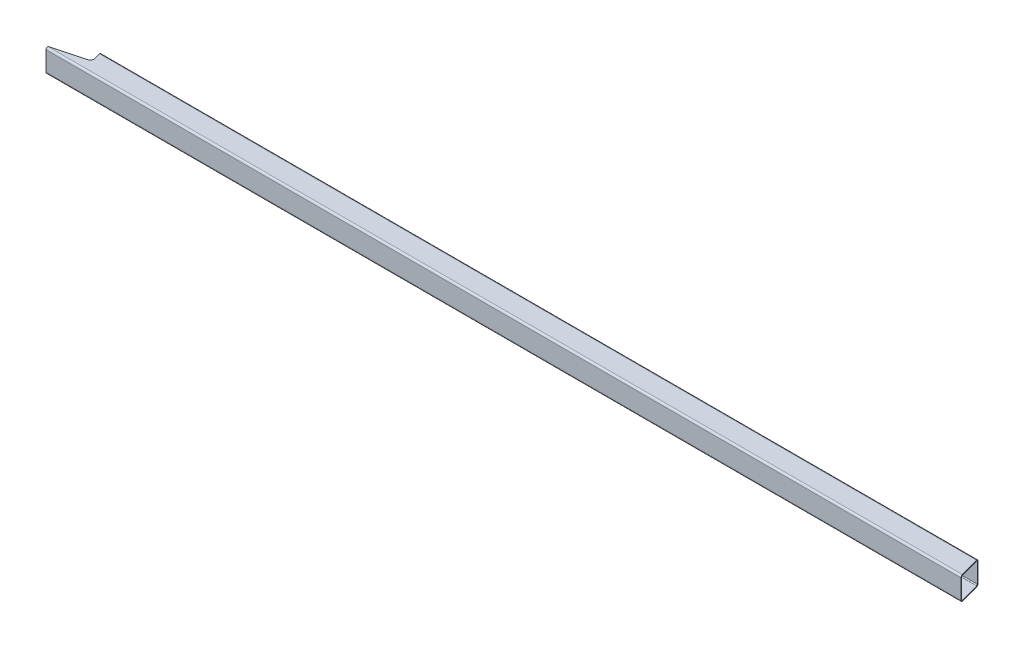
ISO-10303-21;
HEADER;
FILE_DESCRIPTION(('STEP AP214'),'2;1');
FILE_NAME('part.step','',(''),(''),'','','');
FILE_SCHEMA(('AUTOMOTIVE_DESIGN { 1 0 10303 214 1 1 1 1 }'));
ENDSEC;
DATA;
#1=APPLICATION_CONTEXT('core data for automotive mechanical design processes');
#2=APPLICATION_PROTOCOL_DEFINITION('international standard','automotive_design',2000,#1);
#3=PRODUCT_CONTEXT('',#1,'mechanical');
#4=PRODUCT('Part','Part','',(#3));
#5=PRODUCT_RELATED_PRODUCT_CATEGORY('part','',(#4));
#6=PRODUCT_DEFINITION_FORMATION('','',#4);
#7=PRODUCT_DEFINITION_CONTEXT('part definition',#1,'design');
#8=PRODUCT_DEFINITION('design','',#6,#7);
#9=PRODUCT_DEFINITION_SHAPE('','',#8);
#10=(LENGTH_UNIT() NAMED_UNIT(*) SI_UNIT(.MILLI.,.METRE.));
#11=(NAMED_UNIT(*) PLANE_ANGLE_UNIT() SI_UNIT($,.RADIAN.));
#12=(NAMED_UNIT(*) SI_UNIT($,.STERADIAN.) SOLID_ANGLE_UNIT());
#13=UNCERTAINTY_MEASURE_WITH_UNIT(LENGTH_MEASURE(1.E-05),#10,'distance_accuracy_value','');
#14=(GEOMETRIC_REPRESENTATION_CONTEXT(3) GLOBAL_UNCERTAINTY_ASSIGNED_CONTEXT((#13)) GLOBAL_UNIT_ASSIGNED_CONTEXT((#10,
#11,#12)) REPRESENTATION_CONTEXT('',''));
#15=CARTESIAN_POINT('',(0.,0.,0.));
#16=DIRECTION('',(0.,0.,1.));
#17=DIRECTION('',(1.,0.,0.));
#18=AXIS2_PLACEMENT_3D('',#15,#16,#17);
#19=CARTESIAN_POINT('',(0.,32.004,32.004));
#20=DIRECTION('',(1.,0.,0.));
#21=DIRECTION('',(0.,0.,-1.));
#22=AXIS2_PLACEMENT_3D('',#19,#20,#21);
#23=PLANE('',#22);
#24=CARTESIAN_POINT('',(0.,32.004,32.004));
#25=DIRECTION('',(1.,0.,0.));
#26=DIRECTION('',(0.,0.,-1.));
#27=AXIS2_PLACEMENT_3D('',#24,#25,#26);
#28=CIRCLE('',#27,6.096);
#29=CARTESIAN_POINT('',(0.,38.1,32.0040000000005));
#30=VERTEX_POINT('',#29);
#31=CARTESIAN_POINT('',(0.,32.004,38.1));
#32=VERTEX_POINT('',#31);
#33=EDGE_CURVE('E288',#30,#32,#28,.T.);
#34=ORIENTED_EDGE('',*,*,#33,.F.);
#35=DIRECTION('',(0.,-1.,0.));
#36=VECTOR('',#35,1.);
#37=CARTESIAN_POINT('',(0.,32.004,32.0040000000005));
#38=LINE('',#37,#36);
#39=CARTESIAN_POINT('',(0.,35.052,32.0040000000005));
#40=VERTEX_POINT('',#39);
#41=EDGE_CURVE('E280',#30,#40,#38,.T.);
#42=ORIENTED_EDGE('',*,*,#41,.T.);
#43=CARTESIAN_POINT('',(0.,32.004,32.004));
#44=DIRECTION('',(1.,0.,0.));
#45=DIRECTION('',(0.,0.,-1.));
#46=AXIS2_PLACEMENT_3D('',#43,#44,#45);
#47=CIRCLE('',#46,3.048);
#48=CARTESIAN_POINT('',(0.,32.004,35.052));
#49=VERTEX_POINT('',#48);
#50=EDGE_CURVE('E286',#40,#49,#47,.T.);
#51=ORIENTED_EDGE('',*,*,#50,.T.);
#52=DIRECTION('',(0.,-1.,0.));
#53=VECTOR('',#52,1.);
#54=CARTESIAN_POINT('',(0.,32.004,35.052));
#55=LINE('',#54,#53);
#56=CARTESIAN_POINT('',(0.,-32.004,35.052));
#57=VERTEX_POINT('',#56);
#58=EDGE_CURVE('E299',#49,#57,#55,.T.);
#59=ORIENTED_EDGE('',*,*,#58,.T.);
#60=CARTESIAN_POINT('',(0.,-32.004,32.004));
#61=DIRECTION('',(1.,0.,0.));
#62=DIRECTION('',(0.,0.,-1.));
#63=AXIS2_PLACEMENT_3D('',#60,#61,#62);
#64=CIRCLE('',#63,3.04800000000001);
#65=CARTESIAN_POINT('',(0.,-35.052,32.0040000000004));
#66=VERTEX_POINT('',#65);
#67=EDGE_CURVE('E306',#57,#66,#64,.T.);
#68=ORIENTED_EDGE('',*,*,#67,.T.);
#69=CARTESIAN_POINT('',(0.,-38.1,32.0040000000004));
#70=VERTEX_POINT('',#69);
#71=EDGE_CURVE('E292',#66,#70,#38,.T.);
#72=ORIENTED_EDGE('',*,*,#71,.T.);
#73=CARTESIAN_POINT('',(0.,-32.004,32.004));
#74=DIRECTION('',(1.,0.,0.));
#75=DIRECTION('',(0.,0.,-1.));
#76=AXIS2_PLACEMENT_3D('',#73,#74,#75);
#77=CIRCLE('',#76,6.096);
#78=CARTESIAN_POINT('',(0.,-32.004,38.1));
#79=VERTEX_POINT('',#78);
#80=EDGE_CURVE('E210',#79,#70,#77,.T.);
#81=ORIENTED_EDGE('',*,*,#80,.F.);
#82=DIRECTION('',(0.,-1.,0.));
#83=VECTOR('',#82,1.);
#84=CARTESIAN_POINT('',(0.,32.004,38.1));
#85=LINE('',#84,#83);
#86=EDGE_CURVE('E219',#32,#79,#85,.T.);
#87=ORIENTED_EDGE('',*,*,#86,.F.);
#88=EDGE_LOOP('',(#34,#42,#51,#59,#68,#72,#81,#87));
#89=FACE_BOUND('',#88,.T.);
#90=ADVANCED_FACE('F49',(#89),#23,.F.);
#91=CARTESIAN_POINT('',(3048.,32.004,32.004));
#92=DIRECTION('',(-1.,0.,0.));
#93=DIRECTION('',(0.,0.,1.));
#94=AXIS2_PLACEMENT_3D('',#91,#92,#93);
#95=CYLINDRICAL_SURFACE('',#94,6.096);
#96=DIRECTION('',(-1.,0.,0.));
#97=VECTOR('',#96,1.);
#98=CARTESIAN_POINT('',(3048.,32.004,38.1));
#99=LINE('',#98,#97);
#100=CARTESIAN_POINT('',(3013.65132777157,32.004,38.1));
#101=VERTEX_POINT('',#100);
#102=EDGE_CURVE('E199',#101,#32,#99,.T.);
#103=ORIENTED_EDGE('',*,*,#102,.F.);
#104=CARTESIAN_POINT('',(3012.01790949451,32.004,32.004));
#105=DIRECTION('',(-0.965925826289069,0.,0.258819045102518));
#106=DIRECTION('',(-0.258819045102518,0.,-0.965925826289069));
#107=AXIS2_PLACEMENT_3D('',#104,#105,#106);
#108=ELLIPSE('',#107,6.31104359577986,6.096);
#109=CARTESIAN_POINT('',(3012.01790949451,38.1,32.004));
#110=VERTEX_POINT('',#109);
#111=EDGE_CURVE('E186',#101,#110,#108,.T.);
#112=ORIENTED_EDGE('',*,*,#111,.T.);
#113=DIRECTION('',(-1.,0.,0.));
#114=VECTOR('',#113,1.);
#115=CARTESIAN_POINT('',(3048.,38.1,32.004));
#116=LINE('',#115,#114);
#117=EDGE_CURVE('E197',#110,#30,#116,.T.);
#118=ORIENTED_EDGE('',*,*,#117,.T.);
#119=ORIENTED_EDGE('',*,*,#33,.T.);
#120=EDGE_LOOP('',(#103,#112,#118,#119));
#121=FACE_BOUND('',#120,.T.);
#122=ADVANCED_FACE('F51',(#121),#95,.T.);
#123=CARTESIAN_POINT('',(3048.,32.004,38.1));
#124=DIRECTION('',(0.,0.,-1.));
#125=DIRECTION('',(0.,1.,0.));
#126=AXIS2_PLACEMENT_3D('',#123,#124,#125);
#127=PLANE('',#126);
#128=DIRECTION('',(-1.,0.,0.));
#129=VECTOR('',#128,1.);
#130=CARTESIAN_POINT('',(3048.,-32.004,38.1));
#131=LINE('',#130,#129);
#132=CARTESIAN_POINT('',(3013.65132777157,-32.004,38.1));
#133=VERTEX_POINT('',#132);
#134=EDGE_CURVE('E234',#133,#79,#131,.T.);
#135=ORIENTED_EDGE('',*,*,#134,.F.);
#136=DIRECTION('',(0.,1.,0.));
#137=VECTOR('',#136,1.);
#138=CARTESIAN_POINT('',(3013.65132777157,32.004,38.1));
#139=LINE('',#138,#137);
#140=EDGE_CURVE('E202',#133,#101,#139,.T.);
#141=ORIENTED_EDGE('',*,*,#140,.T.);
#142=ORIENTED_EDGE('',*,*,#102,.T.);
#143=ORIENTED_EDGE('',*,*,#86,.T.);
#144=EDGE_LOOP('',(#135,#141,#142,#143));
#145=FACE_BOUND('',#144,.T.);
#146=ADVANCED_FACE('F346',(#145),#127,.F.);
#147=CARTESIAN_POINT('',(3048.,-32.004,32.004));
#148=DIRECTION('',(-1.,0.,0.));
#149=DIRECTION('',(0.,0.,1.));
#150=AXIS2_PLACEMENT_3D('',#147,#148,#149);
#151=CYLINDRICAL_SURFACE('',#150,6.096);
#152=DIRECTION('',(-1.,0.,0.));
#153=VECTOR('',#152,1.);
#154=CARTESIAN_POINT('',(3048.,-38.1,32.004));
#155=LINE('',#154,#153);
#156=CARTESIAN_POINT('',(3012.01790949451,-38.1,32.004));
#157=VERTEX_POINT('',#156);
#158=EDGE_CURVE('E231',#157,#70,#155,.T.);
#159=ORIENTED_EDGE('',*,*,#158,.F.);
#160=CARTESIAN_POINT('',(3012.01790949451,-32.004,32.004));
#161=DIRECTION('',(-0.965925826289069,0.,0.258819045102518));
#162=DIRECTION('',(-0.258819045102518,0.,-0.965925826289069));
#163=AXIS2_PLACEMENT_3D('',#160,#161,#162);
#164=ELLIPSE('',#163,6.31104359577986,6.096);
#165=EDGE_CURVE('E353',#157,#133,#164,.T.);
#166=ORIENTED_EDGE('',*,*,#165,.T.);
#167=ORIENTED_EDGE('',*,*,#134,.T.);
#168=ORIENTED_EDGE('',*,*,#80,.T.);
#169=EDGE_LOOP('',(#159,#166,#167,#168));
#170=FACE_BOUND('',#169,.T.);
#171=ADVANCED_FACE('F351',(#170),#151,.T.);
#172=CARTESIAN_POINT('',(3048.,-38.1,-32.004));
#173=DIRECTION('',(0.,1.,0.));
#174=DIRECTION('',(0.,0.,1.));
#175=AXIS2_PLACEMENT_3D('',#172,#173,#174);
#176=PLANE('',#175);
#177=DIRECTION('',(-1.,0.,0.));
#178=VECTOR('',#177,1.);
#179=CARTESIAN_POINT('',(3048.,-38.1,-32.004));
#180=LINE('',#179,#178);
#181=CARTESIAN_POINT('',(2994.86701758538,-38.1,-32.004));
#182=VERTEX_POINT('',#181);
#183=CARTESIAN_POINT('',(106.362572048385,-38.1,-32.004));
#184=VERTEX_POINT('',#183);
#185=EDGE_CURVE('E228',#182,#184,#180,.T.);
#186=ORIENTED_EDGE('',*,*,#185,.F.);
#187=DIRECTION('',(0.258819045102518,0.,0.965925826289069));
#188=VECTOR('',#187,1.);
#189=CARTESIAN_POINT('',(3031.89818169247,-38.1,106.198185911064));
#190=LINE('',#189,#188);
#191=EDGE_CURVE('E192',#182,#157,#190,.T.);
#192=ORIENTED_EDGE('',*,*,#191,.T.);
#193=ORIENTED_EDGE('',*,*,#158,.T.);
#194=DIRECTION('',(0.965925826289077,0.,-0.258819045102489));
#195=VECTOR('',#194,1.);
#196=CARTESIAN_POINT('',(-20.3280589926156,-38.1,37.4508869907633));
#197=LINE('',#196,#195);
#198=CARTESIAN_POINT('',(102.972372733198,-38.1,4.41263588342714));
#199=VERTEX_POINT('',#198);
#200=EDGE_CURVE('E375',#70,#199,#197,.T.);
#201=ORIENTED_EDGE('',*,*,#200,.T.);
#202=CARTESIAN_POINT('',(99.6853708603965,-38.1,-7.85462211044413));
#203=DIRECTION('',(0.,1.,0.));
#204=DIRECTION('',(0.,0.,1.));
#205=AXIS2_PLACEMENT_3D('',#202,#203,#204);
#206=CIRCLE('',#205,12.7);
#207=CARTESIAN_POINT('',(111.952628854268,-38.1,-11.1416239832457));
#208=VERTEX_POINT('',#207);
#209=EDGE_CURVE('E379',#199,#208,#206,.T.);
#210=ORIENTED_EDGE('',*,*,#209,.T.);
#211=DIRECTION('',(-0.258819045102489,0.,-0.965925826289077));
#212=VECTOR('',#211,1.);
#213=CARTESIAN_POINT('',(87.57750420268,-38.1,-102.110827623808));
#214=LINE('',#213,#212);
#215=EDGE_CURVE('E383',#208,#184,#214,.T.);
#216=ORIENTED_EDGE('',*,*,#215,.T.);
#217=EDGE_LOOP('',(#186,#192,#193,#201,#210,#216));
#218=FACE_BOUND('',#217,.T.);
#219=ADVANCED_FACE('F429',(#218),#176,.F.);
#220=CARTESIAN_POINT('',(3048.,-32.004,-32.004));
#221=DIRECTION('',(-1.,0.,0.));
#222=DIRECTION('',(0.,0.,1.));
#223=AXIS2_PLACEMENT_3D('',#220,#221,#222);
#224=CYLINDRICAL_SURFACE('',#223,6.096);
#225=DIRECTION('',(-1.,0.,0.));
#226=VECTOR('',#225,1.);
#227=CARTESIAN_POINT('',(3048.,-32.004,-38.1));
#228=LINE('',#227,#226);
#229=CARTESIAN_POINT('',(2993.23359930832,-32.004,-38.1));
#230=VERTEX_POINT('',#229);
#231=CARTESIAN_POINT('',(104.729153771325,-32.004,-38.1));
#232=VERTEX_POINT('',#231);
#233=EDGE_CURVE('E225',#230,#232,#228,.T.);
#234=ORIENTED_EDGE('',*,*,#233,.F.);
#235=CARTESIAN_POINT('',(2994.86701758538,-32.004,-32.004));
#236=DIRECTION('',(-0.965925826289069,0.,0.258819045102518));
#237=DIRECTION('',(-0.258819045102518,0.,-0.965925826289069));
#238=AXIS2_PLACEMENT_3D('',#235,#236,#237);
#239=ELLIPSE('',#238,6.31104359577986,6.096);
#240=EDGE_CURVE('E356',#230,#182,#239,.T.);
#241=ORIENTED_EDGE('',*,*,#240,.T.);
#242=ORIENTED_EDGE('',*,*,#185,.T.);
#243=CARTESIAN_POINT('',(106.362572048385,-32.004,-32.004));
#244=DIRECTION('',(0.965925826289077,0.,-0.258819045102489));
#245=DIRECTION('',(-0.258819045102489,0.,-0.965925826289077));
#246=AXIS2_PLACEMENT_3D('',#243,#244,#245);
#247=ELLIPSE('',#246,6.31104359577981,6.096);
#248=EDGE_CURVE('E300',#184,#232,#247,.T.);
#249=ORIENTED_EDGE('',*,*,#248,.T.);
#250=EDGE_LOOP('',(#234,#241,#242,#249));
#251=FACE_BOUND('',#250,.T.);
#252=ADVANCED_FACE('F426',(#251),#224,.T.);
#253=CARTESIAN_POINT('',(3048.,-32.004,-38.1));
#254=DIRECTION('',(0.,0.,1.));
#255=DIRECTION('',(0.,-1.,0.));
#256=AXIS2_PLACEMENT_3D('',#253,#254,#255);
#257=PLANE('',#256);
#258=DIRECTION('',(-1.,0.,0.));
#259=VECTOR('',#258,1.);
#260=CARTESIAN_POINT('',(3048.,32.004,-38.1));
#261=LINE('',#260,#259);
#262=CARTESIAN_POINT('',(2993.23359930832,32.004,-38.1));
#263=VERTEX_POINT('',#262);
#264=CARTESIAN_POINT('',(104.729153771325,32.004,-38.1));
#265=VERTEX_POINT('',#264);
#266=EDGE_CURVE('E216',#263,#265,#261,.T.);
#267=ORIENTED_EDGE('',*,*,#266,.F.);
#268=DIRECTION('',(0.,-1.,0.));
#269=VECTOR('',#268,1.);
#270=CARTESIAN_POINT('',(2993.23359930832,-32.004,-38.1));
#271=LINE('',#270,#269);
#272=EDGE_CURVE('E364',#263,#230,#271,.T.);
#273=ORIENTED_EDGE('',*,*,#272,.T.);
#274=ORIENTED_EDGE('',*,*,#233,.T.);
#275=DIRECTION('',(0.,1.,0.));
#276=VECTOR('',#275,1.);
#277=CARTESIAN_POINT('',(104.729153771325,-32.0039999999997,-38.1));
#278=LINE('',#277,#276);
#279=EDGE_CURVE('E309',#232,#265,#278,.T.);
#280=ORIENTED_EDGE('',*,*,#279,.T.);
#281=EDGE_LOOP('',(#267,#273,#274,#280));
#282=FACE_BOUND('',#281,.T.);
#283=ADVANCED_FACE('F420',(#282),#257,.F.);
#284=CARTESIAN_POINT('',(3048.,32.004,-32.004));
#285=DIRECTION('',(-1.,0.,0.));
#286=DIRECTION('',(0.,0.,1.));
#287=AXIS2_PLACEMENT_3D('',#284,#285,#286);
#288=CYLINDRICAL_SURFACE('',#287,6.096);
#289=DIRECTION('',(-1.,0.,0.));
#290=VECTOR('',#289,1.);
#291=CARTESIAN_POINT('',(3048.,38.1,-32.004));
#292=LINE('',#291,#290);
#293=CARTESIAN_POINT('',(2994.86701758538,38.1,-32.004));
#294=VERTEX_POINT('',#293);
#295=CARTESIAN_POINT('',(106.362572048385,38.1,-32.004));
#296=VERTEX_POINT('',#295);
#297=EDGE_CURVE('E209',#294,#296,#292,.T.);
#298=ORIENTED_EDGE('',*,*,#297,.F.);
#299=CARTESIAN_POINT('',(2994.86701758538,32.004,-32.004));
#300=DIRECTION('',(-0.965925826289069,0.,0.258819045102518));
#301=DIRECTION('',(-0.258819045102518,0.,-0.965925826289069));
#302=AXIS2_PLACEMENT_3D('',#299,#300,#301);
#303=ELLIPSE('',#302,6.31104359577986,6.096);
#304=EDGE_CURVE('E65',#294,#263,#303,.T.);
#305=ORIENTED_EDGE('',*,*,#304,.T.);
#306=ORIENTED_EDGE('',*,*,#266,.T.);
#307=CARTESIAN_POINT('',(106.362572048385,32.004,-32.004));
#308=DIRECTION('',(0.965925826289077,0.,-0.258819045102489));
#309=DIRECTION('',(-0.258819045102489,0.,-0.965925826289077));
#310=AXIS2_PLACEMENT_3D('',#307,#308,#309);
#311=ELLIPSE('',#310,6.31104359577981,6.096);
#312=EDGE_CURVE('E410',#265,#296,#311,.T.);
#313=ORIENTED_EDGE('',*,*,#312,.T.);
#314=EDGE_LOOP('',(#298,#305,#306,#313));
#315=FACE_BOUND('',#314,.T.);
#316=ADVANCED_FACE('F483',(#315),#288,.T.);
#317=CARTESIAN_POINT('',(3048.,38.1,32.004));
#318=DIRECTION('',(0.,-1.,0.));
#319=DIRECTION('',(0.,0.,-1.));
#320=AXIS2_PLACEMENT_3D('',#317,#318,#319);
#321=PLANE('',#320);
#322=ORIENTED_EDGE('',*,*,#117,.F.);
#323=DIRECTION('',(0.258819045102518,0.,0.965925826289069));
#324=VECTOR('',#323,1.);
#325=CARTESIAN_POINT('',(3031.89818169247,38.1,106.198185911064));
#326=LINE('',#325,#324);
#327=EDGE_CURVE('E183',#294,#110,#326,.T.);
#328=ORIENTED_EDGE('',*,*,#327,.F.);
#329=ORIENTED_EDGE('',*,*,#297,.T.);
#330=DIRECTION('',(-0.258819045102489,0.,-0.965925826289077));
#331=VECTOR('',#330,1.);
#332=CARTESIAN_POINT('',(87.57750420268,38.1,-102.110827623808));
#333=LINE('',#332,#331);
#334=CARTESIAN_POINT('',(111.952628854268,38.1,-11.1416239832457));
#335=VERTEX_POINT('',#334);
#336=EDGE_CURVE('E372',#335,#296,#333,.T.);
#337=ORIENTED_EDGE('',*,*,#336,.F.);
#338=CARTESIAN_POINT('',(99.6853708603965,38.1,-7.85462211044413));
#339=DIRECTION('',(0.,1.,0.));
#340=DIRECTION('',(0.,0.,1.));
#341=AXIS2_PLACEMENT_3D('',#338,#339,#340);
#342=CIRCLE('',#341,12.7);
#343=CARTESIAN_POINT('',(102.972372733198,38.1,4.41263588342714));
#344=VERTEX_POINT('',#343);
#345=EDGE_CURVE('E268',#344,#335,#342,.T.);
#346=ORIENTED_EDGE('',*,*,#345,.F.);
#347=DIRECTION('',(0.965925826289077,0.,-0.258819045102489));
#348=VECTOR('',#347,1.);
#349=CARTESIAN_POINT('',(-20.3280589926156,38.1,37.4508869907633));
#350=LINE('',#349,#348);
#351=EDGE_CURVE('E201',#30,#344,#350,.T.);
#352=ORIENTED_EDGE('',*,*,#351,.F.);
#353=EDGE_LOOP('',(#322,#328,#329,#337,#346,#352));
#354=FACE_BOUND('',#353,.T.);
#355=ADVANCED_FACE('F205',(#354),#321,.F.);
#356=CARTESIAN_POINT('',(3048.,32.004,32.004));
#357=DIRECTION('',(-1.,0.,0.));
#358=DIRECTION('',(0.,0.,1.));
#359=AXIS2_PLACEMENT_3D('',#356,#357,#358);
#360=CYLINDRICAL_SURFACE('',#359,3.048);
#361=CARTESIAN_POINT('',(3012.01790949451,32.004,32.004));
#362=DIRECTION('',(-0.965925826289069,0.,0.258819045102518));
#363=DIRECTION('',(-0.258819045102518,0.,-0.965925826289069));
#364=AXIS2_PLACEMENT_3D('',#361,#362,#363);
#365=ELLIPSE('',#364,3.15552179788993,3.048);
#366=CARTESIAN_POINT('',(3012.83461863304,32.004,35.052));
#367=VERTEX_POINT('',#366);
#368=CARTESIAN_POINT('',(3012.01790949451,35.052,32.004));
#369=VERTEX_POINT('',#368);
#370=EDGE_CURVE('E72',#367,#369,#365,.T.);
#371=ORIENTED_EDGE('',*,*,#370,.F.);
#372=DIRECTION('',(-1.,0.,0.));
#373=VECTOR('',#372,1.);
#374=CARTESIAN_POINT('',(3048.,32.004,35.052));
#375=LINE('',#374,#373);
#376=EDGE_CURVE('E296',#367,#49,#375,.T.);
#377=ORIENTED_EDGE('',*,*,#376,.T.);
#378=ORIENTED_EDGE('',*,*,#50,.F.);
#379=DIRECTION('',(-1.,0.,0.));
#380=VECTOR('',#379,1.);
#381=CARTESIAN_POINT('',(3048.,35.052,32.004));
#382=LINE('',#381,#380);
#383=EDGE_CURVE('E276',#369,#40,#382,.T.);
#384=ORIENTED_EDGE('',*,*,#383,.F.);
#385=EDGE_LOOP('',(#371,#377,#378,#384));
#386=FACE_BOUND('',#385,.T.);
#387=ADVANCED_FACE('F294',(#386),#360,.F.);
#388=CARTESIAN_POINT('',(3048.,32.004,35.052));
#389=DIRECTION('',(0.,0.,-1.));
#390=DIRECTION('',(-1.,0.,0.));
#391=AXIS2_PLACEMENT_3D('',#388,#389,#390);
#392=PLANE('',#391);
#393=DIRECTION('',(0.,1.,0.));
#394=VECTOR('',#393,1.);
#395=CARTESIAN_POINT('',(3012.83461863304,32.004,35.052));
#396=LINE('',#395,#394);
#397=CARTESIAN_POINT('',(3012.83461863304,-32.004,35.052));
#398=VERTEX_POINT('',#397);
#399=EDGE_CURVE('E473',#398,#367,#396,.T.);
#400=ORIENTED_EDGE('',*,*,#399,.F.);
#401=DIRECTION('',(-1.,0.,0.));
#402=VECTOR('',#401,1.);
#403=CARTESIAN_POINT('',(3048.,-32.004,35.052));
#404=LINE('',#403,#402);
#405=EDGE_CURVE('E333',#398,#57,#404,.T.);
#406=ORIENTED_EDGE('',*,*,#405,.T.);
#407=ORIENTED_EDGE('',*,*,#58,.F.);
#408=ORIENTED_EDGE('',*,*,#376,.F.);
#409=EDGE_LOOP('',(#400,#406,#407,#408));
#410=FACE_BOUND('',#409,.T.);
#411=ADVANCED_FACE('F500',(#410),#392,.T.);
#412=CARTESIAN_POINT('',(3048.,-32.004,32.004));
#413=DIRECTION('',(-1.,0.,0.));
#414=DIRECTION('',(0.,0.,1.));
#415=AXIS2_PLACEMENT_3D('',#412,#413,#414);
#416=CYLINDRICAL_SURFACE('',#415,3.04800000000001);
#417=CARTESIAN_POINT('',(3012.01790949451,-32.004,32.004));
#418=DIRECTION('',(-0.965925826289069,0.,0.258819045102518));
#419=DIRECTION('',(-0.258819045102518,0.,-0.965925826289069));
#420=AXIS2_PLACEMENT_3D('',#417,#418,#419);
#421=ELLIPSE('',#420,3.15552179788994,3.04800000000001);
#422=CARTESIAN_POINT('',(3012.01790949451,-35.052,32.004));
#423=VERTEX_POINT('',#422);
#424=EDGE_CURVE('E470',#423,#398,#421,.T.);
#425=ORIENTED_EDGE('',*,*,#424,.F.);
#426=DIRECTION('',(-1.,0.,0.));
#427=VECTOR('',#426,1.);
#428=CARTESIAN_POINT('',(3048.,-35.052,32.004));
#429=LINE('',#428,#427);
#430=EDGE_CURVE('E330',#423,#66,#429,.T.);
#431=ORIENTED_EDGE('',*,*,#430,.T.);
#432=ORIENTED_EDGE('',*,*,#67,.F.);
#433=ORIENTED_EDGE('',*,*,#405,.F.);
#434=EDGE_LOOP('',(#425,#431,#432,#433));
#435=FACE_BOUND('',#434,.T.);
#436=ADVANCED_FACE('F503',(#435),#416,.F.);
#437=CARTESIAN_POINT('',(3048.,-35.052,-32.004));
#438=DIRECTION('',(0.,1.,0.));
#439=DIRECTION('',(0.,0.,1.));
#440=AXIS2_PLACEMENT_3D('',#437,#438,#439);
#441=PLANE('',#440);
#442=DIRECTION('',(0.258819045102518,0.,0.965925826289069));
#443=VECTOR('',#442,1.);
#444=CARTESIAN_POINT('',(2998.42625251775,-35.052,-18.7207543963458));
#445=LINE('',#444,#443);
#446=CARTESIAN_POINT('',(2994.86701758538,-35.052,-32.004));
#447=VERTEX_POINT('',#446);
#448=EDGE_CURVE('E441',#447,#423,#445,.T.);
#449=ORIENTED_EDGE('',*,*,#448,.F.);
#450=DIRECTION('',(-1.,0.,0.));
#451=VECTOR('',#450,1.);
#452=CARTESIAN_POINT('',(3048.,-35.052,-32.004));
#453=LINE('',#452,#451);
#454=CARTESIAN_POINT('',(106.362572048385,-35.052,-32.004));
#455=VERTEX_POINT('',#454);
#456=EDGE_CURVE('E327',#447,#455,#453,.T.);
#457=ORIENTED_EDGE('',*,*,#456,.T.);
#458=DIRECTION('',(-0.258819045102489,0.,-0.965925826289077));
#459=VECTOR('',#458,1.);
#460=CARTESIAN_POINT('',(303.414915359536,-35.0520000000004,703.405356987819));
#461=LINE('',#460,#459);
#462=CARTESIAN_POINT('',(111.952628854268,-35.052,-11.1416239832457));
#463=VERTEX_POINT('',#462);
#464=EDGE_CURVE('E406',#463,#455,#461,.T.);
#465=ORIENTED_EDGE('',*,*,#464,.F.);
#466=CARTESIAN_POINT('',(99.6853708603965,-35.052,-7.85462211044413));
#467=DIRECTION('',(0.,1.,0.));
#468=DIRECTION('',(0.,0.,1.));
#469=AXIS2_PLACEMENT_3D('',#466,#467,#468);
#470=CIRCLE('',#469,12.7);
#471=CARTESIAN_POINT('',(102.972372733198,-35.052,4.41263588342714));
#472=VERTEX_POINT('',#471);
#473=EDGE_CURVE('E394',#472,#463,#470,.T.);
#474=ORIENTED_EDGE('',*,*,#473,.F.);
#475=DIRECTION('',(0.965925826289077,0.,-0.258819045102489));
#476=VECTOR('',#475,1.);
#477=CARTESIAN_POINT('',(2859.82471536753,-35.0519999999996,-734.283722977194));
#478=LINE('',#477,#476);
#479=EDGE_CURVE('E290',#66,#472,#478,.T.);
#480=ORIENTED_EDGE('',*,*,#479,.F.);
#481=ORIENTED_EDGE('',*,*,#430,.F.);
#482=EDGE_LOOP('',(#449,#457,#465,#474,#480,#481));
#483=FACE_BOUND('',#482,.T.);
#484=ADVANCED_FACE('F437',(#483),#441,.T.);
#485=CARTESIAN_POINT('',(3048.,-32.004,-32.004));
#486=DIRECTION('',(-1.,0.,0.));
#487=DIRECTION('',(0.,0.,1.));
#488=AXIS2_PLACEMENT_3D('',#485,#486,#487);
#489=CYLINDRICAL_SURFACE('',#488,3.04800000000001);
#490=CARTESIAN_POINT('',(2994.86701758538,-32.004,-32.004));
#491=DIRECTION('',(-0.965925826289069,0.,0.258819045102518));
#492=DIRECTION('',(-0.258819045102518,0.,-0.965925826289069));
#493=AXIS2_PLACEMENT_3D('',#490,#491,#492);
#494=ELLIPSE('',#493,3.15552179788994,3.04800000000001);
#495=CARTESIAN_POINT('',(2994.05030844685,-32.004,-35.052));
#496=VERTEX_POINT('',#495);
#497=EDGE_CURVE('E445',#496,#447,#494,.T.);
#498=ORIENTED_EDGE('',*,*,#497,.F.);
#499=DIRECTION('',(-1.,0.,0.));
#500=VECTOR('',#499,1.);
#501=CARTESIAN_POINT('',(3048.,-32.004,-35.052));
#502=LINE('',#501,#500);
#503=CARTESIAN_POINT('',(105.545862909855,-32.004,-35.052));
#504=VERTEX_POINT('',#503);
#505=EDGE_CURVE('E324',#496,#504,#502,.T.);
#506=ORIENTED_EDGE('',*,*,#505,.T.);
#507=CARTESIAN_POINT('',(106.362572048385,-32.004,-32.004));
#508=DIRECTION('',(0.965925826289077,0.,-0.258819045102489));
#509=DIRECTION('',(-0.258819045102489,0.,-0.965925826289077));
#510=AXIS2_PLACEMENT_3D('',#507,#508,#509);
#511=ELLIPSE('',#510,3.15552179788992,3.04800000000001);
#512=EDGE_CURVE('E402',#455,#504,#511,.T.);
#513=ORIENTED_EDGE('',*,*,#512,.F.);
#514=ORIENTED_EDGE('',*,*,#456,.F.);
#515=EDGE_LOOP('',(#498,#506,#513,#514));
#516=FACE_BOUND('',#515,.T.);
#517=ADVANCED_FACE('F444',(#516),#489,.F.);
#518=CARTESIAN_POINT('',(3048.,-32.004,-35.052));
#519=DIRECTION('',(0.,0.,1.));
#520=DIRECTION('',(0.,-1.,0.));
#521=AXIS2_PLACEMENT_3D('',#518,#519,#520);
#522=PLANE('',#521);
#523=DIRECTION('',(0.,-1.,0.));
#524=VECTOR('',#523,1.);
#525=CARTESIAN_POINT('',(2994.05030844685,-32.004,-35.052));
#526=LINE('',#525,#524);
#527=CARTESIAN_POINT('',(2994.05030844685,32.004,-35.052));
#528=VERTEX_POINT('',#527);
#529=EDGE_CURVE('E452',#528,#496,#526,.T.);
#530=ORIENTED_EDGE('',*,*,#529,.F.);
#531=DIRECTION('',(-1.,0.,0.));
#532=VECTOR('',#531,1.);
#533=CARTESIAN_POINT('',(3048.,32.004,-35.052));
#534=LINE('',#533,#532);
#535=CARTESIAN_POINT('',(105.545862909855,32.004,-35.052));
#536=VERTEX_POINT('',#535);
#537=EDGE_CURVE('E321',#528,#536,#534,.T.);
#538=ORIENTED_EDGE('',*,*,#537,.T.);
#539=DIRECTION('',(0.,1.,0.));
#540=VECTOR('',#539,1.);
#541=CARTESIAN_POINT('',(105.545862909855,-32.0039999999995,-35.052));
#542=LINE('',#541,#540);
#543=EDGE_CURVE('E399',#504,#536,#542,.T.);
#544=ORIENTED_EDGE('',*,*,#543,.F.);
#545=ORIENTED_EDGE('',*,*,#505,.F.);
#546=EDGE_LOOP('',(#530,#538,#544,#545));
#547=FACE_BOUND('',#546,.T.);
#548=ADVANCED_FACE('F450',(#547),#522,.T.);
#549=CARTESIAN_POINT('',(3048.,32.004,-32.004));
#550=DIRECTION('',(-1.,0.,0.));
#551=DIRECTION('',(0.,0.,1.));
#552=AXIS2_PLACEMENT_3D('',#549,#550,#551);
#553=CYLINDRICAL_SURFACE('',#552,3.04800000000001);
#554=CARTESIAN_POINT('',(2994.86701758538,32.004,-32.004));
#555=DIRECTION('',(-0.965925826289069,0.,0.258819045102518));
#556=DIRECTION('',(-0.258819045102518,0.,-0.965925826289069));
#557=AXIS2_PLACEMENT_3D('',#554,#555,#556);
#558=ELLIPSE('',#557,3.15552179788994,3.04800000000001);
#559=CARTESIAN_POINT('',(2994.86701758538,35.052,-32.004));
#560=VERTEX_POINT('',#559);
#561=EDGE_CURVE('E456',#560,#528,#558,.T.);
#562=ORIENTED_EDGE('',*,*,#561,.F.);
#563=DIRECTION('',(-1.,0.,0.));
#564=VECTOR('',#563,1.);
#565=CARTESIAN_POINT('',(3048.,35.052,-32.004));
#566=LINE('',#565,#564);
#567=CARTESIAN_POINT('',(106.362572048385,35.052,-32.004));
#568=VERTEX_POINT('',#567);
#569=EDGE_CURVE('E318',#560,#568,#566,.T.);
#570=ORIENTED_EDGE('',*,*,#569,.T.);
#571=CARTESIAN_POINT('',(106.362572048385,32.004,-32.004));
#572=DIRECTION('',(0.965925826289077,0.,-0.258819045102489));
#573=DIRECTION('',(-0.258819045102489,0.,-0.965925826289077));
#574=AXIS2_PLACEMENT_3D('',#571,#572,#573);
#575=ELLIPSE('',#574,3.15552179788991,3.04800000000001);
#576=EDGE_CURVE('E260',#536,#568,#575,.T.);
#577=ORIENTED_EDGE('',*,*,#576,.F.);
#578=ORIENTED_EDGE('',*,*,#537,.F.);
#579=EDGE_LOOP('',(#562,#570,#577,#578));
#580=FACE_BOUND('',#579,.T.);
#581=ADVANCED_FACE('F455',(#580),#553,.F.);
#582=CARTESIAN_POINT('',(3048.,35.052,32.004));
#583=DIRECTION('',(0.,-1.,0.));
#584=DIRECTION('',(0.,0.,-1.));
#585=AXIS2_PLACEMENT_3D('',#582,#583,#584);
#586=PLANE('',#585);
#587=DIRECTION('',(-0.258819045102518,0.,-0.965925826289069));
#588=VECTOR('',#587,1.);
#589=CARTESIAN_POINT('',(3014.42825251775,35.052,40.9995226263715));
#590=LINE('',#589,#588);
#591=EDGE_CURVE('E11',#369,#560,#590,.T.);
#592=ORIENTED_EDGE('',*,*,#591,.F.);
#593=ORIENTED_EDGE('',*,*,#383,.T.);
#594=DIRECTION('',(-0.965925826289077,0.,0.258819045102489));
#595=VECTOR('',#594,1.);
#596=CARTESIAN_POINT('',(2843.82271536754,35.052,-729.995999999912));
#597=LINE('',#596,#595);
#598=CARTESIAN_POINT('',(102.972372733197,35.052,4.41263588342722));
#599=VERTEX_POINT('',#598);
#600=EDGE_CURVE('E239',#599,#40,#597,.T.);
#601=ORIENTED_EDGE('',*,*,#600,.F.);
#602=CARTESIAN_POINT('',(99.6853708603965,35.052,-7.85462211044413));
#603=DIRECTION('',(0.,-1.,0.));
#604=DIRECTION('',(0.,0.,-1.));
#605=AXIS2_PLACEMENT_3D('',#602,#603,#604);
#606=CIRCLE('',#605,12.7);
#607=CARTESIAN_POINT('',(111.952628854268,35.052,-11.1416239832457));
#608=VERTEX_POINT('',#607);
#609=EDGE_CURVE('E243',#608,#599,#606,.T.);
#610=ORIENTED_EDGE('',*,*,#609,.F.);
#611=DIRECTION('',(0.258819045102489,0.,0.965925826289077));
#612=VECTOR('',#611,1.);
#613=CARTESIAN_POINT('',(319.416915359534,35.052,763.125634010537));
#614=LINE('',#613,#612);
#615=EDGE_CURVE('E58',#568,#608,#614,.T.);
#616=ORIENTED_EDGE('',*,*,#615,.F.);
#617=ORIENTED_EDGE('',*,*,#569,.F.);
#618=EDGE_LOOP('',(#592,#593,#601,#610,#616,#617));
#619=FACE_BOUND('',#618,.T.);
#620=ADVANCED_FACE('F274',(#619),#586,.T.);
#621=CARTESIAN_POINT('',(87.57750420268,-38.1,-102.110827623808));
#622=DIRECTION('',(0.965925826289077,0.,-0.258819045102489));
#623=DIRECTION('',(-0.258819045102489,0.,-0.965925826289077));
#624=AXIS2_PLACEMENT_3D('',#621,#622,#623);
#625=PLANE('',#624);
#626=ORIENTED_EDGE('',*,*,#215,.F.);
#627=DIRECTION('',(0.,1.,0.));
#628=VECTOR('',#627,1.);
#629=CARTESIAN_POINT('',(111.952628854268,-38.1,-11.1416239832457));
#630=LINE('',#629,#628);
#631=EDGE_CURVE('E271',#208,#463,#630,.T.);
#632=ORIENTED_EDGE('',*,*,#631,.T.);
#633=ORIENTED_EDGE('',*,*,#464,.T.);
#634=ORIENTED_EDGE('',*,*,#512,.T.);
#635=ORIENTED_EDGE('',*,*,#543,.T.);
#636=ORIENTED_EDGE('',*,*,#576,.T.);
#637=ORIENTED_EDGE('',*,*,#615,.T.);
#638=EDGE_CURVE('E256',#608,#335,#630,.T.);
#639=ORIENTED_EDGE('',*,*,#638,.T.);
#640=ORIENTED_EDGE('',*,*,#336,.T.);
#641=ORIENTED_EDGE('',*,*,#312,.F.);
#642=ORIENTED_EDGE('',*,*,#279,.F.);
#643=ORIENTED_EDGE('',*,*,#248,.F.);
#644=EDGE_LOOP('',(#626,#632,#633,#634,#635,#636,#637,#639,#640,#641,#642,#643));
#645=FACE_BOUND('',#644,.T.);
#646=ADVANCED_FACE('F254',(#645),#625,.F.);
#647=CARTESIAN_POINT('',(99.6853708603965,-38.1,-7.85462211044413));
#648=DIRECTION('',(0.,1.,0.));
#649=DIRECTION('',(0.,0.,1.));
#650=AXIS2_PLACEMENT_3D('',#647,#648,#649);
#651=CYLINDRICAL_SURFACE('',#650,12.7);
#652=ORIENTED_EDGE('',*,*,#473,.T.);
#653=ORIENTED_EDGE('',*,*,#631,.F.);
#654=ORIENTED_EDGE('',*,*,#209,.F.);
#655=DIRECTION('',(0.,1.,0.));
#656=VECTOR('',#655,1.);
#657=CARTESIAN_POINT('',(102.972372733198,-38.1,4.41263588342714));
#658=LINE('',#657,#656);
#659=EDGE_CURVE('E272',#199,#472,#658,.T.);
#660=ORIENTED_EDGE('',*,*,#659,.T.);
#661=EDGE_LOOP('',(#652,#653,#654,#660));
#662=FACE_BOUND('',#661,.T.);
#663=ADVANCED_FACE('F521',(#662),#651,.F.);
#664=CARTESIAN_POINT('',(-20.3280589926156,-38.1,37.4508869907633));
#665=DIRECTION('',(0.258819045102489,0.,0.965925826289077));
#666=DIRECTION('',(0.965925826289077,0.,-0.258819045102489));
#667=AXIS2_PLACEMENT_3D('',#664,#665,#666);
#668=PLANE('',#667);
#669=ORIENTED_EDGE('',*,*,#479,.T.);
#670=ORIENTED_EDGE('',*,*,#659,.F.);
#671=ORIENTED_EDGE('',*,*,#200,.F.);
#672=ORIENTED_EDGE('',*,*,#71,.F.);
#673=EDGE_LOOP('',(#669,#670,#671,#672));
#674=FACE_BOUND('',#673,.T.);
#675=ADVANCED_FACE('F518',(#674),#668,.F.);
#676=ORIENTED_EDGE('',*,*,#351,.T.);
#677=EDGE_CURVE('E281',#599,#344,#658,.T.);
#678=ORIENTED_EDGE('',*,*,#677,.F.);
#679=ORIENTED_EDGE('',*,*,#600,.T.);
#680=ORIENTED_EDGE('',*,*,#41,.F.);
#681=EDGE_LOOP('',(#676,#678,#679,#680));
#682=FACE_BOUND('',#681,.T.);
#683=ADVANCED_FACE('F279',(#682),#668,.F.);
#684=ORIENTED_EDGE('',*,*,#609,.T.);
#685=ORIENTED_EDGE('',*,*,#677,.T.);
#686=ORIENTED_EDGE('',*,*,#345,.T.);
#687=ORIENTED_EDGE('',*,*,#638,.F.);
#688=EDGE_LOOP('',(#684,#685,#686,#687));
#689=FACE_BOUND('',#688,.T.);
#690=ADVANCED_FACE('F265',(#689),#651,.F.);
#691=CARTESIAN_POINT('',(3031.89818169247,-38.1,106.198185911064));
#692=DIRECTION('',(-0.965925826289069,0.,0.258819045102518));
#693=DIRECTION('',(0.258819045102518,0.,0.965925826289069));
#694=AXIS2_PLACEMENT_3D('',#691,#692,#693);
#695=PLANE('',#694);
#696=ORIENTED_EDGE('',*,*,#370,.T.);
#697=ORIENTED_EDGE('',*,*,#591,.T.);
#698=ORIENTED_EDGE('',*,*,#561,.T.);
#699=ORIENTED_EDGE('',*,*,#529,.T.);
#700=ORIENTED_EDGE('',*,*,#497,.T.);
#701=ORIENTED_EDGE('',*,*,#448,.T.);
#702=ORIENTED_EDGE('',*,*,#424,.T.);
#703=ORIENTED_EDGE('',*,*,#399,.T.);
#704=EDGE_LOOP('',(#696,#697,#698,#699,#700,#701,#702,#703));
#705=FACE_BOUND('',#704,.T.);
#706=ORIENTED_EDGE('',*,*,#140,.F.);
#707=ORIENTED_EDGE('',*,*,#165,.F.);
#708=ORIENTED_EDGE('',*,*,#191,.F.);
#709=ORIENTED_EDGE('',*,*,#240,.F.);
#710=ORIENTED_EDGE('',*,*,#272,.F.);
#711=ORIENTED_EDGE('',*,*,#304,.F.);
#712=ORIENTED_EDGE('',*,*,#327,.T.);
#713=ORIENTED_EDGE('',*,*,#111,.F.);
#714=EDGE_LOOP('',(#706,#707,#708,#709,#710,#711,#712,#713));
#715=FACE_BOUND('',#714,.T.);
#716=ADVANCED_FACE('F185',(#705,#715),#695,.F.);
#717=CLOSED_SHELL('',(#90,#122,#146,#171,#219,#252,#283,#316,#355,#387,#411,#436,#484,#517,#548,
#581,#620,#646,#663,#675,#683,#690,#716));
#718=MANIFOLD_SOLID_BREP('B2',#717);
#719=ADVANCED_BREP_SHAPE_REPRESENTATION('',(#18,#718),#14);
#720=SHAPE_DEFINITION_REPRESENTATION(#9,#719);
ENDSEC;
END-ISO-10303-21;
